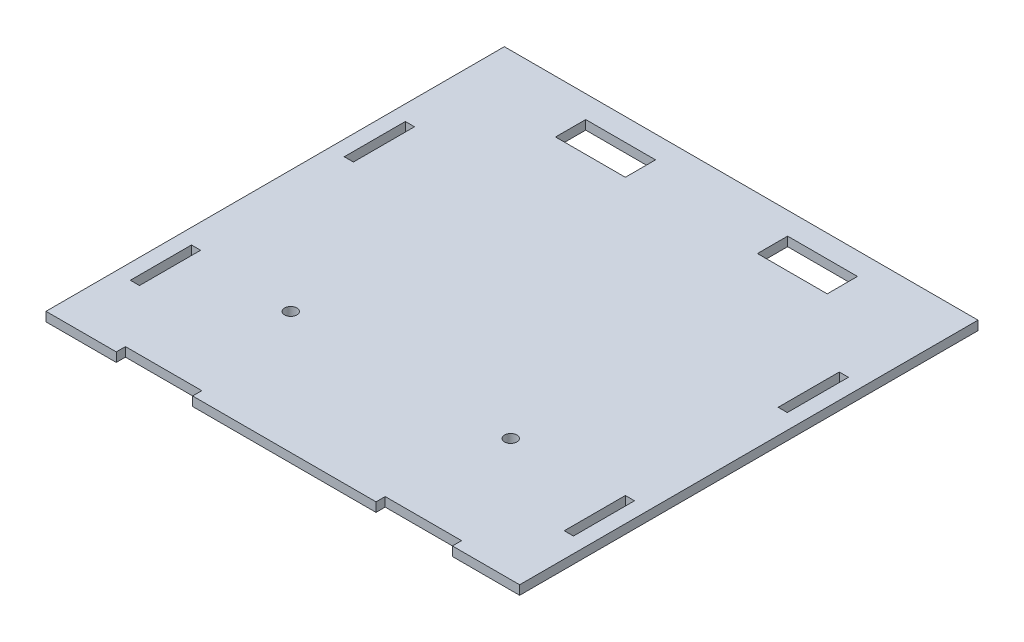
ISO-10303-21;
HEADER;
FILE_DESCRIPTION(('STEP AP214'),'2;1');
FILE_NAME('part.step','',(''),(''),'','','');
FILE_SCHEMA(('AUTOMOTIVE_DESIGN { 1 0 10303 214 1 1 1 1 }'));
ENDSEC;
DATA;
#1=APPLICATION_CONTEXT('core data for automotive mechanical design processes');
#2=APPLICATION_PROTOCOL_DEFINITION('international standard','automotive_design',2000,#1);
#3=PRODUCT_CONTEXT('',#1,'mechanical');
#4=PRODUCT('Part','Part','',(#3));
#5=PRODUCT_RELATED_PRODUCT_CATEGORY('part','',(#4));
#6=PRODUCT_DEFINITION_FORMATION('','',#4);
#7=PRODUCT_DEFINITION_CONTEXT('part definition',#1,'design');
#8=PRODUCT_DEFINITION('design','',#6,#7);
#9=PRODUCT_DEFINITION_SHAPE('','',#8);
#10=(LENGTH_UNIT() NAMED_UNIT(*) SI_UNIT(.MILLI.,.METRE.));
#11=(NAMED_UNIT(*) PLANE_ANGLE_UNIT() SI_UNIT($,.RADIAN.));
#12=(NAMED_UNIT(*) SI_UNIT($,.STERADIAN.) SOLID_ANGLE_UNIT());
#13=UNCERTAINTY_MEASURE_WITH_UNIT(LENGTH_MEASURE(1.E-05),#10,'distance_accuracy_value','');
#14=(GEOMETRIC_REPRESENTATION_CONTEXT(3) GLOBAL_UNCERTAINTY_ASSIGNED_CONTEXT((#13)) GLOBAL_UNIT_ASSIGNED_CONTEXT((#10,
#11,#12)) REPRESENTATION_CONTEXT('',''));
#15=CARTESIAN_POINT('',(0.,0.,0.));
#16=DIRECTION('',(0.,0.,1.));
#17=DIRECTION('',(1.,0.,0.));
#18=AXIS2_PLACEMENT_3D('',#15,#16,#17);
#19=CARTESIAN_POINT('',(-77.5,3.,75.));
#20=DIRECTION('',(0.,0.,-1.));
#21=DIRECTION('',(-1.,0.,0.));
#22=AXIS2_PLACEMENT_3D('',#19,#20,#21);
#23=PLANE('',#22);
#24=DIRECTION('',(1.,0.,0.));
#25=VECTOR('',#24,1.);
#26=CARTESIAN_POINT('',(-77.5,0.,75.));
#27=LINE('',#26,#25);
#28=CARTESIAN_POINT('',(-77.5,0.,75.));
#29=VERTEX_POINT('',#28);
#30=CARTESIAN_POINT('',(-54.5,0.,75.));
#31=VERTEX_POINT('',#30);
#32=EDGE_CURVE('E513',#29,#31,#27,.T.);
#33=ORIENTED_EDGE('',*,*,#32,.T.);
#34=DIRECTION('',(0.,-1.,0.));
#35=VECTOR('',#34,1.);
#36=CARTESIAN_POINT('',(-54.5,10.,75.));
#37=LINE('',#36,#35);
#38=CARTESIAN_POINT('',(-54.5,3.,75.));
#39=VERTEX_POINT('',#38);
#40=EDGE_CURVE('E410',#39,#31,#37,.T.);
#41=ORIENTED_EDGE('',*,*,#40,.F.);
#42=DIRECTION('',(1.,0.,0.));
#43=VECTOR('',#42,1.);
#44=CARTESIAN_POINT('',(-77.5,3.,75.));
#45=LINE('',#44,#43);
#46=CARTESIAN_POINT('',(-77.5,3.,75.));
#47=VERTEX_POINT('',#46);
#48=EDGE_CURVE('E518',#47,#39,#45,.T.);
#49=ORIENTED_EDGE('',*,*,#48,.F.);
#50=DIRECTION('',(0.,-1.,0.));
#51=VECTOR('',#50,1.);
#52=CARTESIAN_POINT('',(-77.5,3.,75.));
#53=LINE('',#52,#51);
#54=EDGE_CURVE('E535',#47,#29,#53,.T.);
#55=ORIENTED_EDGE('',*,*,#54,.T.);
#56=EDGE_LOOP('',(#33,#41,#49,#55));
#57=FACE_BOUND('',#56,.T.);
#58=ADVANCED_FACE('F35',(#57),#23,.F.);
#59=CARTESIAN_POINT('',(55.5,3.,75.));
#60=VERTEX_POINT('',#59);
#61=CARTESIAN_POINT('',(77.5,3.,75.));
#62=VERTEX_POINT('',#61);
#63=EDGE_CURVE('E517',#60,#62,#45,.T.);
#64=ORIENTED_EDGE('',*,*,#63,.F.);
#65=DIRECTION('',(0.,-1.,0.));
#66=VECTOR('',#65,1.);
#67=CARTESIAN_POINT('',(55.5,10.,75.));
#68=LINE('',#67,#66);
#69=CARTESIAN_POINT('',(55.5,0.,75.));
#70=VERTEX_POINT('',#69);
#71=EDGE_CURVE('E433',#60,#70,#68,.T.);
#72=ORIENTED_EDGE('',*,*,#71,.T.);
#73=CARTESIAN_POINT('',(77.5,0.,75.));
#74=VERTEX_POINT('',#73);
#75=EDGE_CURVE('E529',#70,#74,#27,.T.);
#76=ORIENTED_EDGE('',*,*,#75,.T.);
#77=DIRECTION('',(0.,-1.,0.));
#78=VECTOR('',#77,1.);
#79=CARTESIAN_POINT('',(77.5,3.,75.));
#80=LINE('',#79,#78);
#81=EDGE_CURVE('E521',#62,#74,#80,.T.);
#82=ORIENTED_EDGE('',*,*,#81,.F.);
#83=EDGE_LOOP('',(#64,#72,#76,#82));
#84=FACE_BOUND('',#83,.T.);
#85=ADVANCED_FACE('F585',(#84),#23,.F.);
#86=CARTESIAN_POINT('',(77.5,3.,-75.));
#87=DIRECTION('',(-1.,0.,0.));
#88=DIRECTION('',(0.,0.,1.));
#89=AXIS2_PLACEMENT_3D('',#86,#87,#88);
#90=PLANE('',#89);
#91=DIRECTION('',(0.,0.,-1.));
#92=VECTOR('',#91,1.);
#93=CARTESIAN_POINT('',(77.5,0.,-75.));
#94=LINE('',#93,#92);
#95=CARTESIAN_POINT('',(77.5,0.,-75.));
#96=VERTEX_POINT('',#95);
#97=EDGE_CURVE('E508',#74,#96,#94,.T.);
#98=ORIENTED_EDGE('',*,*,#97,.T.);
#99=DIRECTION('',(0.,-1.,0.));
#100=VECTOR('',#99,1.);
#101=CARTESIAN_POINT('',(77.5,3.,-75.));
#102=LINE('',#101,#100);
#103=CARTESIAN_POINT('',(77.5,3.,-75.));
#104=VERTEX_POINT('',#103);
#105=EDGE_CURVE('E11',#104,#96,#102,.T.);
#106=ORIENTED_EDGE('',*,*,#105,.F.);
#107=DIRECTION('',(0.,0.,-1.));
#108=VECTOR('',#107,1.);
#109=CARTESIAN_POINT('',(77.5,3.,-75.));
#110=LINE('',#109,#108);
#111=EDGE_CURVE('E509',#62,#104,#110,.T.);
#112=ORIENTED_EDGE('',*,*,#111,.F.);
#113=ORIENTED_EDGE('',*,*,#81,.T.);
#114=EDGE_LOOP('',(#98,#106,#112,#113));
#115=FACE_BOUND('',#114,.T.);
#116=ADVANCED_FACE('F37',(#115),#90,.F.);
#117=CARTESIAN_POINT('',(-77.5,3.,-75.));
#118=DIRECTION('',(0.,0.,1.));
#119=DIRECTION('',(1.,0.,0.));
#120=AXIS2_PLACEMENT_3D('',#117,#118,#119);
#121=PLANE('',#120);
#122=DIRECTION('',(-1.,0.,0.));
#123=VECTOR('',#122,1.);
#124=CARTESIAN_POINT('',(-77.5,0.,-75.));
#125=LINE('',#124,#123);
#126=CARTESIAN_POINT('',(-77.5,0.,-75.));
#127=VERTEX_POINT('',#126);
#128=EDGE_CURVE('E525',#96,#127,#125,.T.);
#129=ORIENTED_EDGE('',*,*,#128,.T.);
#130=DIRECTION('',(0.,-1.,0.));
#131=VECTOR('',#130,1.);
#132=CARTESIAN_POINT('',(-77.5,3.,-75.));
#133=LINE('',#132,#131);
#134=CARTESIAN_POINT('',(-77.5,3.,-75.));
#135=VERTEX_POINT('',#134);
#136=EDGE_CURVE('E43',#135,#127,#133,.T.);
#137=ORIENTED_EDGE('',*,*,#136,.F.);
#138=DIRECTION('',(-1.,0.,0.));
#139=VECTOR('',#138,1.);
#140=CARTESIAN_POINT('',(-77.5,3.,-75.));
#141=LINE('',#140,#139);
#142=EDGE_CURVE('E512',#104,#135,#141,.T.);
#143=ORIENTED_EDGE('',*,*,#142,.F.);
#144=ORIENTED_EDGE('',*,*,#105,.T.);
#145=EDGE_LOOP('',(#129,#137,#143,#144));
#146=FACE_BOUND('',#145,.T.);
#147=ADVANCED_FACE('F560',(#146),#121,.F.);
#148=CARTESIAN_POINT('',(-77.5,3.,-75.));
#149=DIRECTION('',(1.,0.,0.));
#150=DIRECTION('',(0.,0.,-1.));
#151=AXIS2_PLACEMENT_3D('',#148,#149,#150);
#152=PLANE('',#151);
#153=DIRECTION('',(0.,0.,1.));
#154=VECTOR('',#153,1.);
#155=CARTESIAN_POINT('',(-77.5,0.,-75.));
#156=LINE('',#155,#154);
#157=EDGE_CURVE('E527',#127,#29,#156,.T.);
#158=ORIENTED_EDGE('',*,*,#157,.T.);
#159=ORIENTED_EDGE('',*,*,#54,.F.);
#160=DIRECTION('',(0.,0.,1.));
#161=VECTOR('',#160,1.);
#162=CARTESIAN_POINT('',(-77.5,3.,-75.));
#163=LINE('',#162,#161);
#164=EDGE_CURVE('E515',#135,#47,#163,.T.);
#165=ORIENTED_EDGE('',*,*,#164,.F.);
#166=ORIENTED_EDGE('',*,*,#136,.T.);
#167=EDGE_LOOP('',(#158,#159,#165,#166));
#168=FACE_BOUND('',#167,.T.);
#169=ADVANCED_FACE('F542',(#168),#152,.F.);
#170=CARTESIAN_POINT('',(-29.510112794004,3.,75.));
#171=VERTEX_POINT('',#170);
#172=CARTESIAN_POINT('',(30.5,3.,75.));
#173=VERTEX_POINT('',#172);
#174=EDGE_CURVE('E522',#171,#173,#45,.T.);
#175=ORIENTED_EDGE('',*,*,#174,.F.);
#176=DIRECTION('',(0.,-1.,0.));
#177=VECTOR('',#176,1.);
#178=CARTESIAN_POINT('',(-29.510112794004,10.,75.));
#179=LINE('',#178,#177);
#180=CARTESIAN_POINT('',(-29.510112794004,0.,75.));
#181=VERTEX_POINT('',#180);
#182=EDGE_CURVE('E413',#171,#181,#179,.T.);
#183=ORIENTED_EDGE('',*,*,#182,.T.);
#184=CARTESIAN_POINT('',(30.5,0.,75.));
#185=VERTEX_POINT('',#184);
#186=EDGE_CURVE('E532',#181,#185,#27,.T.);
#187=ORIENTED_EDGE('',*,*,#186,.T.);
#188=DIRECTION('',(0.,-1.,0.));
#189=VECTOR('',#188,1.);
#190=CARTESIAN_POINT('',(30.5,10.,75.));
#191=LINE('',#190,#189);
#192=EDGE_CURVE('E439',#173,#185,#191,.T.);
#193=ORIENTED_EDGE('',*,*,#192,.F.);
#194=EDGE_LOOP('',(#175,#183,#187,#193));
#195=FACE_BOUND('',#194,.T.);
#196=ADVANCED_FACE('F571',(#195),#23,.F.);
#197=CARTESIAN_POINT('',(0.,3.,0.));
#198=DIRECTION('',(0.,1.,0.));
#199=DIRECTION('',(0.,0.,1.));
#200=AXIS2_PLACEMENT_3D('',#197,#198,#199);
#201=PLANE('',#200);
#202=DIRECTION('',(0.,0.,-1.));
#203=VECTOR('',#202,1.);
#204=CARTESIAN_POINT('',(-20.6864428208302,3.,0.));
#205=LINE('',#204,#203);
#206=CARTESIAN_POINT('',(-20.6864428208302,3.,-57.7781504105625));
#207=VERTEX_POINT('',#206);
#208=CARTESIAN_POINT('',(-20.6864428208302,3.,-67.6582425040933));
#209=VERTEX_POINT('',#208);
#210=EDGE_CURVE('E301',#207,#209,#205,.T.);
#211=ORIENTED_EDGE('',*,*,#210,.F.);
#212=DIRECTION('',(1.,0.,0.));
#213=VECTOR('',#212,1.);
#214=CARTESIAN_POINT('',(0.,3.,-57.7781504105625));
#215=LINE('',#214,#213);
#216=CARTESIAN_POINT('',(-43.5341557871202,3.,-57.7781504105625));
#217=VERTEX_POINT('',#216);
#218=EDGE_CURVE('E294',#217,#207,#215,.T.);
#219=ORIENTED_EDGE('',*,*,#218,.F.);
#220=DIRECTION('',(0.,0.,1.));
#221=VECTOR('',#220,1.);
#222=CARTESIAN_POINT('',(-43.5341557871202,3.,0.));
#223=LINE('',#222,#221);
#224=CARTESIAN_POINT('',(-43.5341557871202,3.,-67.6582425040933));
#225=VERTEX_POINT('',#224);
#226=EDGE_CURVE('E274',#225,#217,#223,.T.);
#227=ORIENTED_EDGE('',*,*,#226,.F.);
#228=DIRECTION('',(-1.,0.,0.));
#229=VECTOR('',#228,1.);
#230=CARTESIAN_POINT('',(0.,3.,-67.6582425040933));
#231=LINE('',#230,#229);
#232=EDGE_CURVE('E299',#209,#225,#231,.T.);
#233=ORIENTED_EDGE('',*,*,#232,.F.);
#234=EDGE_LOOP('',(#211,#219,#227,#233));
#235=FACE_BOUND('',#234,.T.);
#236=DIRECTION('',(0.,0.,-1.));
#237=VECTOR('',#236,1.);
#238=CARTESIAN_POINT('',(45.3866730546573,3.,0.));
#239=LINE('',#238,#237);
#240=CARTESIAN_POINT('',(45.3866730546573,3.,-57.7781504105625));
#241=VERTEX_POINT('',#240);
#242=CARTESIAN_POINT('',(45.3866730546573,3.,-67.6582425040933));
#243=VERTEX_POINT('',#242);
#244=EDGE_CURVE('E330',#241,#243,#239,.T.);
#245=ORIENTED_EDGE('',*,*,#244,.F.);
#246=DIRECTION('',(1.,0.,0.));
#247=VECTOR('',#246,1.);
#248=CARTESIAN_POINT('',(0.,3.,-57.7781504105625));
#249=LINE('',#248,#247);
#250=CARTESIAN_POINT('',(22.5389600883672,3.,-57.7781504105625));
#251=VERTEX_POINT('',#250);
#252=EDGE_CURVE('E317',#251,#241,#249,.T.);
#253=ORIENTED_EDGE('',*,*,#252,.F.);
#254=DIRECTION('',(0.,0.,1.));
#255=VECTOR('',#254,1.);
#256=CARTESIAN_POINT('',(22.5389600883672,3.,0.));
#257=LINE('',#256,#255);
#258=CARTESIAN_POINT('',(22.5389600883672,3.,-67.6582425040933));
#259=VERTEX_POINT('',#258);
#260=EDGE_CURVE('E325',#259,#251,#257,.T.);
#261=ORIENTED_EDGE('',*,*,#260,.F.);
#262=DIRECTION('',(-1.,0.,0.));
#263=VECTOR('',#262,1.);
#264=CARTESIAN_POINT('',(0.,3.,-67.6582425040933));
#265=LINE('',#264,#263);
#266=EDGE_CURVE('E328',#243,#259,#265,.T.);
#267=ORIENTED_EDGE('',*,*,#266,.F.);
#268=EDGE_LOOP('',(#245,#253,#261,#267));
#269=FACE_BOUND('',#268,.T.);
#270=CARTESIAN_POINT('',(34.5881566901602,3.,34.9999999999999));
#271=DIRECTION('',(0.,1.,0.));
#272=DIRECTION('',(0.,0.,1.));
#273=AXIS2_PLACEMENT_3D('',#270,#271,#272);
#274=CIRCLE('',#273,2.);
#275=CARTESIAN_POINT('',(34.5881566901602,3.,36.9999999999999));
#276=VERTEX_POINT('',#275);
#277=EDGE_CURVE('E335',#276,#276,#274,.T.);
#278=ORIENTED_EDGE('',*,*,#277,.F.);
#279=EDGE_LOOP('',(#278));
#280=FACE_BOUND('',#279,.T.);
#281=CARTESIAN_POINT('',(-37.4118433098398,3.,35.));
#282=DIRECTION('',(0.,1.,0.));
#283=DIRECTION('',(0.,0.,1.));
#284=AXIS2_PLACEMENT_3D('',#281,#282,#283);
#285=CIRCLE('',#284,2.);
#286=CARTESIAN_POINT('',(-37.4118433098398,3.,37.));
#287=VERTEX_POINT('',#286);
#288=EDGE_CURVE('E341',#287,#287,#285,.T.);
#289=ORIENTED_EDGE('',*,*,#288,.F.);
#290=EDGE_LOOP('',(#289));
#291=FACE_BOUND('',#290,.T.);
#292=DIRECTION('',(0.,0.,-1.));
#293=VECTOR('',#292,1.);
#294=CARTESIAN_POINT('',(-69.5000000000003,3.,0.));
#295=LINE('',#294,#293);
#296=CARTESIAN_POINT('',(-69.5000000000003,3.,-17.5950285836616));
#297=VERTEX_POINT('',#296);
#298=CARTESIAN_POINT('',(-69.5000000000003,3.,-37.5950285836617));
#299=VERTEX_POINT('',#298);
#300=EDGE_CURVE('E371',#297,#299,#295,.T.);
#301=ORIENTED_EDGE('',*,*,#300,.F.);
#302=DIRECTION('',(1.,0.,0.));
#303=VECTOR('',#302,1.);
#304=CARTESIAN_POINT('',(0.,3.,-17.5950285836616));
#305=LINE('',#304,#303);
#306=CARTESIAN_POINT('',(-72.5000000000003,3.,-17.5950285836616));
#307=VERTEX_POINT('',#306);
#308=EDGE_CURVE('E358',#307,#297,#305,.T.);
#309=ORIENTED_EDGE('',*,*,#308,.F.);
#310=DIRECTION('',(0.,0.,1.));
#311=VECTOR('',#310,1.);
#312=CARTESIAN_POINT('',(-72.5000000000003,3.,0.));
#313=LINE('',#312,#311);
#314=CARTESIAN_POINT('',(-72.5000000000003,3.,-37.5950285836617));
#315=VERTEX_POINT('',#314);
#316=EDGE_CURVE('E366',#315,#307,#313,.T.);
#317=ORIENTED_EDGE('',*,*,#316,.F.);
#318=DIRECTION('',(-1.,0.,0.));
#319=VECTOR('',#318,1.);
#320=CARTESIAN_POINT('',(0.,3.,-37.5950285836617));
#321=LINE('',#320,#319);
#322=EDGE_CURVE('E369',#299,#315,#321,.T.);
#323=ORIENTED_EDGE('',*,*,#322,.F.);
#324=EDGE_LOOP('',(#301,#309,#317,#323));
#325=FACE_BOUND('',#324,.T.);
#326=DIRECTION('',(0.,0.,-1.));
#327=VECTOR('',#326,1.);
#328=CARTESIAN_POINT('',(-69.5000000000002,3.,0.));
#329=LINE('',#328,#327);
#330=CARTESIAN_POINT('',(-69.5000000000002,3.,52.4049714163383));
#331=VERTEX_POINT('',#330);
#332=CARTESIAN_POINT('',(-69.5000000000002,3.,32.4049714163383));
#333=VERTEX_POINT('',#332);
#334=EDGE_CURVE('E400',#331,#333,#329,.T.);
#335=ORIENTED_EDGE('',*,*,#334,.F.);
#336=DIRECTION('',(1.,0.,0.));
#337=VECTOR('',#336,1.);
#338=CARTESIAN_POINT('',(0.,3.,52.4049714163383));
#339=LINE('',#338,#337);
#340=CARTESIAN_POINT('',(-72.5000000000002,3.,52.4049714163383));
#341=VERTEX_POINT('',#340);
#342=EDGE_CURVE('E387',#341,#331,#339,.T.);
#343=ORIENTED_EDGE('',*,*,#342,.F.);
#344=DIRECTION('',(0.,0.,1.));
#345=VECTOR('',#344,1.);
#346=CARTESIAN_POINT('',(-72.5000000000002,3.,0.));
#347=LINE('',#346,#345);
#348=CARTESIAN_POINT('',(-72.5000000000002,3.,32.4049714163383));
#349=VERTEX_POINT('',#348);
#350=EDGE_CURVE('E395',#349,#341,#347,.T.);
#351=ORIENTED_EDGE('',*,*,#350,.F.);
#352=DIRECTION('',(-1.,0.,0.));
#353=VECTOR('',#352,1.);
#354=CARTESIAN_POINT('',(0.,3.,32.4049714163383));
#355=LINE('',#354,#353);
#356=EDGE_CURVE('E398',#333,#349,#355,.T.);
#357=ORIENTED_EDGE('',*,*,#356,.F.);
#358=EDGE_LOOP('',(#335,#343,#351,#357));
#359=FACE_BOUND('',#358,.T.);
#360=DIRECTION('',(0.,0.,1.));
#361=VECTOR('',#360,1.);
#362=CARTESIAN_POINT('',(-54.5,3.,0.));
#363=LINE('',#362,#361);
#364=CARTESIAN_POINT('',(-54.5,3.,72.0000000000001));
#365=VERTEX_POINT('',#364);
#366=EDGE_CURVE('E423',#365,#39,#363,.T.);
#367=ORIENTED_EDGE('',*,*,#366,.F.);
#368=DIRECTION('',(-1.,0.,0.));
#369=VECTOR('',#368,1.);
#370=CARTESIAN_POINT('',(0.,3.,72.0000000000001));
#371=LINE('',#370,#369);
#372=CARTESIAN_POINT('',(-29.510112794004,3.,72.0000000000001));
#373=VERTEX_POINT('',#372);
#374=EDGE_CURVE('E412',#373,#365,#371,.T.);
#375=ORIENTED_EDGE('',*,*,#374,.F.);
#376=DIRECTION('',(0.,0.,-1.));
#377=VECTOR('',#376,1.);
#378=CARTESIAN_POINT('',(-29.510112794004,3.,0.));
#379=LINE('',#378,#377);
#380=EDGE_CURVE('E421',#171,#373,#379,.T.);
#381=ORIENTED_EDGE('',*,*,#380,.F.);
#382=ORIENTED_EDGE('',*,*,#174,.T.);
#383=DIRECTION('',(0.,0.,1.));
#384=VECTOR('',#383,1.);
#385=CARTESIAN_POINT('',(30.5,3.,0.));
#386=LINE('',#385,#384);
#387=CARTESIAN_POINT('',(30.5,3.,72.));
#388=VERTEX_POINT('',#387);
#389=EDGE_CURVE('E436',#388,#173,#386,.T.);
#390=ORIENTED_EDGE('',*,*,#389,.F.);
#391=DIRECTION('',(-1.,0.,0.));
#392=VECTOR('',#391,1.);
#393=CARTESIAN_POINT('',(0.,3.,72.));
#394=LINE('',#393,#392);
#395=CARTESIAN_POINT('',(55.5,3.,72.));
#396=VERTEX_POINT('',#395);
#397=EDGE_CURVE('E446',#396,#388,#394,.T.);
#398=ORIENTED_EDGE('',*,*,#397,.F.);
#399=DIRECTION('',(0.,0.,-1.));
#400=VECTOR('',#399,1.);
#401=CARTESIAN_POINT('',(55.5,3.,0.));
#402=LINE('',#401,#400);
#403=EDGE_CURVE('E448',#60,#396,#402,.T.);
#404=ORIENTED_EDGE('',*,*,#403,.F.);
#405=ORIENTED_EDGE('',*,*,#63,.T.);
#406=ORIENTED_EDGE('',*,*,#111,.T.);
#407=ORIENTED_EDGE('',*,*,#142,.T.);
#408=ORIENTED_EDGE('',*,*,#164,.T.);
#409=ORIENTED_EDGE('',*,*,#48,.T.);
#410=EDGE_LOOP('',(#367,#375,#381,#382,#390,#398,#404,#405,#406,#407,#408,#409));
#411=FACE_BOUND('',#410,.T.);
#412=DIRECTION('',(0.,0.,-1.));
#413=VECTOR('',#412,1.);
#414=CARTESIAN_POINT('',(72.5,3.,0.));
#415=LINE('',#414,#413);
#416=CARTESIAN_POINT('',(72.5,3.,52.4049589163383));
#417=VERTEX_POINT('',#416);
#418=CARTESIAN_POINT('',(72.5,3.,32.4049589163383));
#419=VERTEX_POINT('',#418);
#420=EDGE_CURVE('E477',#417,#419,#415,.T.);
#421=ORIENTED_EDGE('',*,*,#420,.F.);
#422=DIRECTION('',(1.,0.,0.));
#423=VECTOR('',#422,1.);
#424=CARTESIAN_POINT('',(0.,3.,52.4049589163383));
#425=LINE('',#424,#423);
#426=CARTESIAN_POINT('',(69.5,3.,52.4049589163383));
#427=VERTEX_POINT('',#426);
#428=EDGE_CURVE('E464',#427,#417,#425,.T.);
#429=ORIENTED_EDGE('',*,*,#428,.F.);
#430=DIRECTION('',(0.,0.,1.));
#431=VECTOR('',#430,1.);
#432=CARTESIAN_POINT('',(69.5,3.,0.));
#433=LINE('',#432,#431);
#434=CARTESIAN_POINT('',(69.5,3.,32.4049589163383));
#435=VERTEX_POINT('',#434);
#436=EDGE_CURVE('E472',#435,#427,#433,.T.);
#437=ORIENTED_EDGE('',*,*,#436,.F.);
#438=DIRECTION('',(-1.,0.,0.));
#439=VECTOR('',#438,1.);
#440=CARTESIAN_POINT('',(0.,3.,32.4049589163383));
#441=LINE('',#440,#439);
#442=EDGE_CURVE('E475',#419,#435,#441,.T.);
#443=ORIENTED_EDGE('',*,*,#442,.F.);
#444=EDGE_LOOP('',(#421,#429,#437,#443));
#445=FACE_BOUND('',#444,.T.);
#446=DIRECTION('',(0.,0.,1.));
#447=VECTOR('',#446,1.);
#448=CARTESIAN_POINT('',(69.4999999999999,3.,0.));
#449=LINE('',#448,#447);
#450=CARTESIAN_POINT('',(69.4999999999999,3.,-37.5950410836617));
#451=VERTEX_POINT('',#450);
#452=CARTESIAN_POINT('',(69.4999999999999,3.,-17.5950410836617));
#453=VERTEX_POINT('',#452);
#454=EDGE_CURVE('E506',#451,#453,#449,.T.);
#455=ORIENTED_EDGE('',*,*,#454,.F.);
#456=DIRECTION('',(-1.,0.,0.));
#457=VECTOR('',#456,1.);
#458=CARTESIAN_POINT('',(0.,3.,-37.5950410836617));
#459=LINE('',#458,#457);
#460=CARTESIAN_POINT('',(72.4999999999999,3.,-37.5950410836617));
#461=VERTEX_POINT('',#460);
#462=EDGE_CURVE('E493',#461,#451,#459,.T.);
#463=ORIENTED_EDGE('',*,*,#462,.F.);
#464=DIRECTION('',(0.,0.,-1.));
#465=VECTOR('',#464,1.);
#466=CARTESIAN_POINT('',(72.4999999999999,3.,0.));
#467=LINE('',#466,#465);
#468=CARTESIAN_POINT('',(72.4999999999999,3.,-17.5950410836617));
#469=VERTEX_POINT('',#468);
#470=EDGE_CURVE('E501',#469,#461,#467,.T.);
#471=ORIENTED_EDGE('',*,*,#470,.F.);
#472=DIRECTION('',(1.,0.,0.));
#473=VECTOR('',#472,1.);
#474=CARTESIAN_POINT('',(0.,3.,-17.5950410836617));
#475=LINE('',#474,#473);
#476=EDGE_CURVE('E504',#453,#469,#475,.T.);
#477=ORIENTED_EDGE('',*,*,#476,.F.);
#478=EDGE_LOOP('',(#455,#463,#471,#477));
#479=FACE_BOUND('',#478,.T.);
#480=ADVANCED_FACE('F555',(#235,#269,#280,#291,#325,#359,#411,#445,#479),#201,.T.);
#481=CARTESIAN_POINT('',(0.,0.,0.));
#482=DIRECTION('',(0.,1.,0.));
#483=DIRECTION('',(0.,0.,1.));
#484=AXIS2_PLACEMENT_3D('',#481,#482,#483);
#485=PLANE('',#484);
#486=DIRECTION('',(-1.,0.,0.));
#487=VECTOR('',#486,1.);
#488=CARTESIAN_POINT('',(-20.6864428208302,0.,-57.7781504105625));
#489=LINE('',#488,#487);
#490=CARTESIAN_POINT('',(-20.6864428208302,0.,-57.7781504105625));
#491=VERTEX_POINT('',#490);
#492=CARTESIAN_POINT('',(-43.5341557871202,0.,-57.7781504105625));
#493=VERTEX_POINT('',#492);
#494=EDGE_CURVE('E280',#491,#493,#489,.T.);
#495=ORIENTED_EDGE('',*,*,#494,.F.);
#496=DIRECTION('',(0.,0.,1.));
#497=VECTOR('',#496,1.);
#498=CARTESIAN_POINT('',(-20.6864428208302,0.,-57.7781504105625));
#499=LINE('',#498,#497);
#500=CARTESIAN_POINT('',(-20.6864428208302,0.,-67.6582425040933));
#501=VERTEX_POINT('',#500);
#502=EDGE_CURVE('E58',#501,#491,#499,.T.);
#503=ORIENTED_EDGE('',*,*,#502,.F.);
#504=DIRECTION('',(1.,0.,0.));
#505=VECTOR('',#504,1.);
#506=CARTESIAN_POINT('',(-20.6864428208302,0.,-67.6582425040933));
#507=LINE('',#506,#505);
#508=CARTESIAN_POINT('',(-43.5341557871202,0.,-67.6582425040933));
#509=VERTEX_POINT('',#508);
#510=EDGE_CURVE('E287',#509,#501,#507,.T.);
#511=ORIENTED_EDGE('',*,*,#510,.F.);
#512=DIRECTION('',(0.,0.,-1.));
#513=VECTOR('',#512,1.);
#514=CARTESIAN_POINT('',(-43.5341557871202,0.,-57.7781504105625));
#515=LINE('',#514,#513);
#516=EDGE_CURVE('E271',#493,#509,#515,.T.);
#517=ORIENTED_EDGE('',*,*,#516,.F.);
#518=EDGE_LOOP('',(#495,#503,#511,#517));
#519=FACE_BOUND('',#518,.T.);
#520=DIRECTION('',(-1.,0.,0.));
#521=VECTOR('',#520,1.);
#522=CARTESIAN_POINT('',(45.3866730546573,0.,-57.7781504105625));
#523=LINE('',#522,#521);
#524=CARTESIAN_POINT('',(45.3866730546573,0.,-57.7781504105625));
#525=VERTEX_POINT('',#524);
#526=CARTESIAN_POINT('',(22.5389600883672,0.,-57.7781504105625));
#527=VERTEX_POINT('',#526);
#528=EDGE_CURVE('E305',#525,#527,#523,.T.);
#529=ORIENTED_EDGE('',*,*,#528,.F.);
#530=DIRECTION('',(0.,0.,1.));
#531=VECTOR('',#530,1.);
#532=CARTESIAN_POINT('',(45.3866730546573,0.,-57.7781504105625));
#533=LINE('',#532,#531);
#534=CARTESIAN_POINT('',(45.3866730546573,0.,-67.6582425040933));
#535=VERTEX_POINT('',#534);
#536=EDGE_CURVE('E303',#535,#525,#533,.T.);
#537=ORIENTED_EDGE('',*,*,#536,.F.);
#538=DIRECTION('',(1.,0.,0.));
#539=VECTOR('',#538,1.);
#540=CARTESIAN_POINT('',(45.3866730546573,0.,-67.6582425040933));
#541=LINE('',#540,#539);
#542=CARTESIAN_POINT('',(22.5389600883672,0.,-67.6582425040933));
#543=VERTEX_POINT('',#542);
#544=EDGE_CURVE('E311',#543,#535,#541,.T.);
#545=ORIENTED_EDGE('',*,*,#544,.F.);
#546=DIRECTION('',(0.,0.,-1.));
#547=VECTOR('',#546,1.);
#548=CARTESIAN_POINT('',(22.5389600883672,0.,-57.7781504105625));
#549=LINE('',#548,#547);
#550=EDGE_CURVE('E308',#527,#543,#549,.T.);
#551=ORIENTED_EDGE('',*,*,#550,.F.);
#552=EDGE_LOOP('',(#529,#537,#545,#551));
#553=FACE_BOUND('',#552,.T.);
#554=CARTESIAN_POINT('',(34.5881566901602,0.,34.9999999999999));
#555=DIRECTION('',(0.,-1.,0.));
#556=DIRECTION('',(0.,0.,-1.));
#557=AXIS2_PLACEMENT_3D('',#554,#555,#556);
#558=CIRCLE('',#557,2.);
#559=CARTESIAN_POINT('',(34.5881566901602,0.,32.9999999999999));
#560=VERTEX_POINT('',#559);
#561=EDGE_CURVE('E332',#560,#560,#558,.T.);
#562=ORIENTED_EDGE('',*,*,#561,.F.);
#563=EDGE_LOOP('',(#562));
#564=FACE_BOUND('',#563,.T.);
#565=CARTESIAN_POINT('',(-37.4118433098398,0.,35.));
#566=DIRECTION('',(0.,-1.,0.));
#567=DIRECTION('',(0.,0.,-1.));
#568=AXIS2_PLACEMENT_3D('',#565,#566,#567);
#569=CIRCLE('',#568,2.);
#570=CARTESIAN_POINT('',(-37.4118433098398,0.,33.));
#571=VERTEX_POINT('',#570);
#572=EDGE_CURVE('E338',#571,#571,#569,.T.);
#573=ORIENTED_EDGE('',*,*,#572,.F.);
#574=EDGE_LOOP('',(#573));
#575=FACE_BOUND('',#574,.T.);
#576=DIRECTION('',(-1.,0.,0.));
#577=VECTOR('',#576,1.);
#578=CARTESIAN_POINT('',(-69.5000000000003,0.,-17.5950285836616));
#579=LINE('',#578,#577);
#580=CARTESIAN_POINT('',(-69.5000000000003,0.,-17.5950285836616));
#581=VERTEX_POINT('',#580);
#582=CARTESIAN_POINT('',(-72.5000000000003,0.,-17.5950285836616));
#583=VERTEX_POINT('',#582);
#584=EDGE_CURVE('E346',#581,#583,#579,.T.);
#585=ORIENTED_EDGE('',*,*,#584,.F.);
#586=DIRECTION('',(0.,0.,1.));
#587=VECTOR('',#586,1.);
#588=CARTESIAN_POINT('',(-69.5000000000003,0.,-17.5950285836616));
#589=LINE('',#588,#587);
#590=CARTESIAN_POINT('',(-69.5000000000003,0.,-37.5950285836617));
#591=VERTEX_POINT('',#590);
#592=EDGE_CURVE('E344',#591,#581,#589,.T.);
#593=ORIENTED_EDGE('',*,*,#592,.F.);
#594=DIRECTION('',(1.,0.,0.));
#595=VECTOR('',#594,1.);
#596=CARTESIAN_POINT('',(-69.5000000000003,0.,-37.5950285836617));
#597=LINE('',#596,#595);
#598=CARTESIAN_POINT('',(-72.5000000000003,0.,-37.5950285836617));
#599=VERTEX_POINT('',#598);
#600=EDGE_CURVE('E352',#599,#591,#597,.T.);
#601=ORIENTED_EDGE('',*,*,#600,.F.);
#602=DIRECTION('',(0.,0.,-1.));
#603=VECTOR('',#602,1.);
#604=CARTESIAN_POINT('',(-72.5000000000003,0.,-17.5950285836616));
#605=LINE('',#604,#603);
#606=EDGE_CURVE('E349',#583,#599,#605,.T.);
#607=ORIENTED_EDGE('',*,*,#606,.F.);
#608=EDGE_LOOP('',(#585,#593,#601,#607));
#609=FACE_BOUND('',#608,.T.);
#610=DIRECTION('',(-1.,0.,0.));
#611=VECTOR('',#610,1.);
#612=CARTESIAN_POINT('',(-69.5000000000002,0.,52.4049714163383));
#613=LINE('',#612,#611);
#614=CARTESIAN_POINT('',(-69.5000000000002,0.,52.4049714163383));
#615=VERTEX_POINT('',#614);
#616=CARTESIAN_POINT('',(-72.5000000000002,0.,52.4049714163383));
#617=VERTEX_POINT('',#616);
#618=EDGE_CURVE('E375',#615,#617,#613,.T.);
#619=ORIENTED_EDGE('',*,*,#618,.F.);
#620=DIRECTION('',(0.,0.,1.));
#621=VECTOR('',#620,1.);
#622=CARTESIAN_POINT('',(-69.5000000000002,0.,32.4049714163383));
#623=LINE('',#622,#621);
#624=CARTESIAN_POINT('',(-69.5000000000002,0.,32.4049714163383));
#625=VERTEX_POINT('',#624);
#626=EDGE_CURVE('E373',#625,#615,#623,.T.);
#627=ORIENTED_EDGE('',*,*,#626,.F.);
#628=DIRECTION('',(1.,0.,0.));
#629=VECTOR('',#628,1.);
#630=CARTESIAN_POINT('',(-69.5000000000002,0.,32.4049714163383));
#631=LINE('',#630,#629);
#632=CARTESIAN_POINT('',(-72.5000000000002,0.,32.4049714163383));
#633=VERTEX_POINT('',#632);
#634=EDGE_CURVE('E381',#633,#625,#631,.T.);
#635=ORIENTED_EDGE('',*,*,#634,.F.);
#636=DIRECTION('',(0.,0.,-1.));
#637=VECTOR('',#636,1.);
#638=CARTESIAN_POINT('',(-72.5000000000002,0.,32.4049714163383));
#639=LINE('',#638,#637);
#640=EDGE_CURVE('E378',#617,#633,#639,.T.);
#641=ORIENTED_EDGE('',*,*,#640,.F.);
#642=EDGE_LOOP('',(#619,#627,#635,#641));
#643=FACE_BOUND('',#642,.T.);
#644=DIRECTION('',(-1.,0.,0.));
#645=VECTOR('',#644,1.);
#646=CARTESIAN_POINT('',(72.5,0.,52.4049589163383));
#647=LINE('',#646,#645);
#648=CARTESIAN_POINT('',(72.5,0.,52.4049589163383));
#649=VERTEX_POINT('',#648);
#650=CARTESIAN_POINT('',(69.5,0.,52.4049589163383));
#651=VERTEX_POINT('',#650);
#652=EDGE_CURVE('E452',#649,#651,#647,.T.);
#653=ORIENTED_EDGE('',*,*,#652,.F.);
#654=DIRECTION('',(0.,0.,1.));
#655=VECTOR('',#654,1.);
#656=CARTESIAN_POINT('',(72.5,0.,32.4049589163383));
#657=LINE('',#656,#655);
#658=CARTESIAN_POINT('',(72.5,0.,32.4049589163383));
#659=VERTEX_POINT('',#658);
#660=EDGE_CURVE('E450',#659,#649,#657,.T.);
#661=ORIENTED_EDGE('',*,*,#660,.F.);
#662=DIRECTION('',(1.,0.,0.));
#663=VECTOR('',#662,1.);
#664=CARTESIAN_POINT('',(72.5,0.,32.4049589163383));
#665=LINE('',#664,#663);
#666=CARTESIAN_POINT('',(69.5,0.,32.4049589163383));
#667=VERTEX_POINT('',#666);
#668=EDGE_CURVE('E458',#667,#659,#665,.T.);
#669=ORIENTED_EDGE('',*,*,#668,.F.);
#670=DIRECTION('',(0.,0.,-1.));
#671=VECTOR('',#670,1.);
#672=CARTESIAN_POINT('',(69.5,0.,32.4049589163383));
#673=LINE('',#672,#671);
#674=EDGE_CURVE('E455',#651,#667,#673,.T.);
#675=ORIENTED_EDGE('',*,*,#674,.F.);
#676=EDGE_LOOP('',(#653,#661,#669,#675));
#677=FACE_BOUND('',#676,.T.);
#678=DIRECTION('',(1.,0.,0.));
#679=VECTOR('',#678,1.);
#680=CARTESIAN_POINT('',(69.4999999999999,0.,-37.5950410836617));
#681=LINE('',#680,#679);
#682=CARTESIAN_POINT('',(69.4999999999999,0.,-37.5950410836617));
#683=VERTEX_POINT('',#682);
#684=CARTESIAN_POINT('',(72.4999999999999,0.,-37.5950410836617));
#685=VERTEX_POINT('',#684);
#686=EDGE_CURVE('E481',#683,#685,#681,.T.);
#687=ORIENTED_EDGE('',*,*,#686,.F.);
#688=DIRECTION('',(0.,0.,-1.));
#689=VECTOR('',#688,1.);
#690=CARTESIAN_POINT('',(69.4999999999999,0.,-17.5950410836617));
#691=LINE('',#690,#689);
#692=CARTESIAN_POINT('',(69.4999999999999,0.,-17.5950410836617));
#693=VERTEX_POINT('',#692);
#694=EDGE_CURVE('E479',#693,#683,#691,.T.);
#695=ORIENTED_EDGE('',*,*,#694,.F.);
#696=DIRECTION('',(-1.,0.,0.));
#697=VECTOR('',#696,1.);
#698=CARTESIAN_POINT('',(69.4999999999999,0.,-17.5950410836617));
#699=LINE('',#698,#697);
#700=CARTESIAN_POINT('',(72.4999999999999,0.,-17.5950410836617));
#701=VERTEX_POINT('',#700);
#702=EDGE_CURVE('E487',#701,#693,#699,.T.);
#703=ORIENTED_EDGE('',*,*,#702,.F.);
#704=DIRECTION('',(0.,0.,1.));
#705=VECTOR('',#704,1.);
#706=CARTESIAN_POINT('',(72.4999999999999,0.,-17.5950410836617));
#707=LINE('',#706,#705);
#708=EDGE_CURVE('E484',#685,#701,#707,.T.);
#709=ORIENTED_EDGE('',*,*,#708,.F.);
#710=EDGE_LOOP('',(#687,#695,#703,#709));
#711=FACE_BOUND('',#710,.T.);
#712=DIRECTION('',(1.,0.,0.));
#713=VECTOR('',#712,1.);
#714=CARTESIAN_POINT('',(-54.5,0.,72.0000000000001));
#715=LINE('',#714,#713);
#716=CARTESIAN_POINT('',(-54.5,0.,72.0000000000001));
#717=VERTEX_POINT('',#716);
#718=CARTESIAN_POINT('',(-29.510112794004,0.,72.0000000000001));
#719=VERTEX_POINT('',#718);
#720=EDGE_CURVE('E404',#717,#719,#715,.T.);
#721=ORIENTED_EDGE('',*,*,#720,.F.);
#722=DIRECTION('',(0.,0.,-1.));
#723=VECTOR('',#722,1.);
#724=CARTESIAN_POINT('',(-54.5,0.,72.0000000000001));
#725=LINE('',#724,#723);
#726=EDGE_CURVE('E402',#31,#717,#725,.T.);
#727=ORIENTED_EDGE('',*,*,#726,.F.);
#728=ORIENTED_EDGE('',*,*,#32,.F.);
#729=ORIENTED_EDGE('',*,*,#157,.F.);
#730=ORIENTED_EDGE('',*,*,#128,.F.);
#731=ORIENTED_EDGE('',*,*,#97,.F.);
#732=ORIENTED_EDGE('',*,*,#75,.F.);
#733=DIRECTION('',(0.,0.,1.));
#734=VECTOR('',#733,1.);
#735=CARTESIAN_POINT('',(55.5,0.,72.));
#736=LINE('',#735,#734);
#737=CARTESIAN_POINT('',(55.5,0.,72.));
#738=VERTEX_POINT('',#737);
#739=EDGE_CURVE('E425',#738,#70,#736,.T.);
#740=ORIENTED_EDGE('',*,*,#739,.F.);
#741=DIRECTION('',(1.,0.,0.));
#742=VECTOR('',#741,1.);
#743=CARTESIAN_POINT('',(55.5,0.,72.));
#744=LINE('',#743,#742);
#745=CARTESIAN_POINT('',(30.5,0.,72.));
#746=VERTEX_POINT('',#745);
#747=EDGE_CURVE('E430',#746,#738,#744,.T.);
#748=ORIENTED_EDGE('',*,*,#747,.F.);
#749=DIRECTION('',(0.,0.,-1.));
#750=VECTOR('',#749,1.);
#751=CARTESIAN_POINT('',(30.5,0.,72.));
#752=LINE('',#751,#750);
#753=EDGE_CURVE('E427',#185,#746,#752,.T.);
#754=ORIENTED_EDGE('',*,*,#753,.F.);
#755=ORIENTED_EDGE('',*,*,#186,.F.);
#756=DIRECTION('',(0.,0.,1.));
#757=VECTOR('',#756,1.);
#758=CARTESIAN_POINT('',(-29.510112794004,0.,72.0000000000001));
#759=LINE('',#758,#757);
#760=EDGE_CURVE('E407',#719,#181,#759,.T.);
#761=ORIENTED_EDGE('',*,*,#760,.F.);
#762=EDGE_LOOP('',(#721,#727,#728,#729,#730,#731,#732,#740,#748,#754,#755,#761));
#763=FACE_BOUND('',#762,.T.);
#764=ADVANCED_FACE('F284',(#519,#553,#564,#575,#609,#643,#677,#711,#763),#485,.F.);
#765=CARTESIAN_POINT('',(69.4999999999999,10.,-17.5950410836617));
#766=DIRECTION('',(-1.,0.,0.));
#767=DIRECTION('',(0.,0.,1.));
#768=AXIS2_PLACEMENT_3D('',#765,#766,#767);
#769=PLANE('',#768);
#770=ORIENTED_EDGE('',*,*,#454,.T.);
#771=DIRECTION('',(0.,-1.,0.));
#772=VECTOR('',#771,1.);
#773=CARTESIAN_POINT('',(69.4999999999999,10.,-17.5950410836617));
#774=LINE('',#773,#772);
#775=EDGE_CURVE('E491',#453,#693,#774,.T.);
#776=ORIENTED_EDGE('',*,*,#775,.T.);
#777=ORIENTED_EDGE('',*,*,#694,.T.);
#778=DIRECTION('',(0.,-1.,0.));
#779=VECTOR('',#778,1.);
#780=CARTESIAN_POINT('',(69.4999999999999,10.,-37.5950410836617));
#781=LINE('',#780,#779);
#782=EDGE_CURVE('E490',#451,#683,#781,.T.);
#783=ORIENTED_EDGE('',*,*,#782,.F.);
#784=EDGE_LOOP('',(#770,#776,#777,#783));
#785=FACE_BOUND('',#784,.T.);
#786=ADVANCED_FACE('F636',(#785),#769,.F.);
#787=CARTESIAN_POINT('',(69.4999999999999,10.,-17.5950410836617));
#788=DIRECTION('',(0.,0.,1.));
#789=DIRECTION('',(1.,0.,0.));
#790=AXIS2_PLACEMENT_3D('',#787,#788,#789);
#791=PLANE('',#790);
#792=ORIENTED_EDGE('',*,*,#476,.T.);
#793=DIRECTION('',(0.,-1.,0.));
#794=VECTOR('',#793,1.);
#795=CARTESIAN_POINT('',(72.4999999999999,10.,-17.5950410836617));
#796=LINE('',#795,#794);
#797=EDGE_CURVE('E494',#469,#701,#796,.T.);
#798=ORIENTED_EDGE('',*,*,#797,.T.);
#799=ORIENTED_EDGE('',*,*,#702,.T.);
#800=ORIENTED_EDGE('',*,*,#775,.F.);
#801=EDGE_LOOP('',(#792,#798,#799,#800));
#802=FACE_BOUND('',#801,.T.);
#803=ADVANCED_FACE('F651',(#802),#791,.F.);
#804=CARTESIAN_POINT('',(72.4999999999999,10.,-17.5950410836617));
#805=DIRECTION('',(1.,0.,0.));
#806=DIRECTION('',(0.,0.,-1.));
#807=AXIS2_PLACEMENT_3D('',#804,#805,#806);
#808=PLANE('',#807);
#809=ORIENTED_EDGE('',*,*,#470,.T.);
#810=DIRECTION('',(0.,-1.,0.));
#811=VECTOR('',#810,1.);
#812=CARTESIAN_POINT('',(72.4999999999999,10.,-37.5950410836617));
#813=LINE('',#812,#811);
#814=EDGE_CURVE('E496',#461,#685,#813,.T.);
#815=ORIENTED_EDGE('',*,*,#814,.T.);
#816=ORIENTED_EDGE('',*,*,#708,.T.);
#817=ORIENTED_EDGE('',*,*,#797,.F.);
#818=EDGE_LOOP('',(#809,#815,#816,#817));
#819=FACE_BOUND('',#818,.T.);
#820=ADVANCED_FACE('F660',(#819),#808,.F.);
#821=CARTESIAN_POINT('',(69.4999999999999,10.,-37.5950410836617));
#822=DIRECTION('',(0.,0.,-1.));
#823=DIRECTION('',(-1.,0.,0.));
#824=AXIS2_PLACEMENT_3D('',#821,#822,#823);
#825=PLANE('',#824);
#826=ORIENTED_EDGE('',*,*,#462,.T.);
#827=ORIENTED_EDGE('',*,*,#782,.T.);
#828=ORIENTED_EDGE('',*,*,#686,.T.);
#829=ORIENTED_EDGE('',*,*,#814,.F.);
#830=EDGE_LOOP('',(#826,#827,#828,#829));
#831=FACE_BOUND('',#830,.T.);
#832=ADVANCED_FACE('F669',(#831),#825,.F.);
#833=CARTESIAN_POINT('',(72.5,10.,32.4049589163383));
#834=DIRECTION('',(1.,0.,0.));
#835=DIRECTION('',(0.,0.,-1.));
#836=AXIS2_PLACEMENT_3D('',#833,#834,#835);
#837=PLANE('',#836);
#838=ORIENTED_EDGE('',*,*,#420,.T.);
#839=DIRECTION('',(0.,-1.,0.));
#840=VECTOR('',#839,1.);
#841=CARTESIAN_POINT('',(72.5,10.,32.4049589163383));
#842=LINE('',#841,#840);
#843=EDGE_CURVE('E462',#419,#659,#842,.T.);
#844=ORIENTED_EDGE('',*,*,#843,.T.);
#845=ORIENTED_EDGE('',*,*,#660,.T.);
#846=DIRECTION('',(0.,-1.,0.));
#847=VECTOR('',#846,1.);
#848=CARTESIAN_POINT('',(72.5,10.,52.4049589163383));
#849=LINE('',#848,#847);
#850=EDGE_CURVE('E461',#417,#649,#849,.T.);
#851=ORIENTED_EDGE('',*,*,#850,.F.);
#852=EDGE_LOOP('',(#838,#844,#845,#851));
#853=FACE_BOUND('',#852,.T.);
#854=ADVANCED_FACE('F678',(#853),#837,.F.);
#855=CARTESIAN_POINT('',(72.5,10.,32.4049589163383));
#856=DIRECTION('',(0.,0.,-1.));
#857=DIRECTION('',(-1.,0.,0.));
#858=AXIS2_PLACEMENT_3D('',#855,#856,#857);
#859=PLANE('',#858);
#860=ORIENTED_EDGE('',*,*,#442,.T.);
#861=DIRECTION('',(0.,-1.,0.));
#862=VECTOR('',#861,1.);
#863=CARTESIAN_POINT('',(69.5,10.,32.4049589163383));
#864=LINE('',#863,#862);
#865=EDGE_CURVE('E465',#435,#667,#864,.T.);
#866=ORIENTED_EDGE('',*,*,#865,.T.);
#867=ORIENTED_EDGE('',*,*,#668,.T.);
#868=ORIENTED_EDGE('',*,*,#843,.F.);
#869=EDGE_LOOP('',(#860,#866,#867,#868));
#870=FACE_BOUND('',#869,.T.);
#871=ADVANCED_FACE('F687',(#870),#859,.F.);
#872=CARTESIAN_POINT('',(69.5,10.,32.4049589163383));
#873=DIRECTION('',(-1.,0.,0.));
#874=DIRECTION('',(0.,0.,1.));
#875=AXIS2_PLACEMENT_3D('',#872,#873,#874);
#876=PLANE('',#875);
#877=ORIENTED_EDGE('',*,*,#436,.T.);
#878=DIRECTION('',(0.,-1.,0.));
#879=VECTOR('',#878,1.);
#880=CARTESIAN_POINT('',(69.5,10.,52.4049589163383));
#881=LINE('',#880,#879);
#882=EDGE_CURVE('E467',#427,#651,#881,.T.);
#883=ORIENTED_EDGE('',*,*,#882,.T.);
#884=ORIENTED_EDGE('',*,*,#674,.T.);
#885=ORIENTED_EDGE('',*,*,#865,.F.);
#886=EDGE_LOOP('',(#877,#883,#884,#885));
#887=FACE_BOUND('',#886,.T.);
#888=ADVANCED_FACE('F696',(#887),#876,.F.);
#889=CARTESIAN_POINT('',(72.5,10.,52.4049589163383));
#890=DIRECTION('',(0.,0.,1.));
#891=DIRECTION('',(1.,0.,0.));
#892=AXIS2_PLACEMENT_3D('',#889,#890,#891);
#893=PLANE('',#892);
#894=ORIENTED_EDGE('',*,*,#428,.T.);
#895=ORIENTED_EDGE('',*,*,#850,.T.);
#896=ORIENTED_EDGE('',*,*,#652,.T.);
#897=ORIENTED_EDGE('',*,*,#882,.F.);
#898=EDGE_LOOP('',(#894,#895,#896,#897));
#899=FACE_BOUND('',#898,.T.);
#900=ADVANCED_FACE('F705',(#899),#893,.F.);
#901=CARTESIAN_POINT('',(55.5,10.,72.));
#902=DIRECTION('',(1.,0.,0.));
#903=DIRECTION('',(0.,0.,-1.));
#904=AXIS2_PLACEMENT_3D('',#901,#902,#903);
#905=PLANE('',#904);
#906=ORIENTED_EDGE('',*,*,#403,.T.);
#907=DIRECTION('',(0.,-1.,0.));
#908=VECTOR('',#907,1.);
#909=CARTESIAN_POINT('',(55.5,10.,72.));
#910=LINE('',#909,#908);
#911=EDGE_CURVE('E434',#396,#738,#910,.T.);
#912=ORIENTED_EDGE('',*,*,#911,.T.);
#913=ORIENTED_EDGE('',*,*,#739,.T.);
#914=ORIENTED_EDGE('',*,*,#71,.F.);
#915=EDGE_LOOP('',(#906,#912,#913,#914));
#916=FACE_BOUND('',#915,.T.);
#917=ADVANCED_FACE('F714',(#916),#905,.F.);
#918=CARTESIAN_POINT('',(55.5,10.,72.));
#919=DIRECTION('',(0.,0.,-1.));
#920=DIRECTION('',(-1.,0.,0.));
#921=AXIS2_PLACEMENT_3D('',#918,#919,#920);
#922=PLANE('',#921);
#923=ORIENTED_EDGE('',*,*,#397,.T.);
#924=DIRECTION('',(0.,-1.,0.));
#925=VECTOR('',#924,1.);
#926=CARTESIAN_POINT('',(30.5,10.,72.));
#927=LINE('',#926,#925);
#928=EDGE_CURVE('E437',#388,#746,#927,.T.);
#929=ORIENTED_EDGE('',*,*,#928,.T.);
#930=ORIENTED_EDGE('',*,*,#747,.T.);
#931=ORIENTED_EDGE('',*,*,#911,.F.);
#932=EDGE_LOOP('',(#923,#929,#930,#931));
#933=FACE_BOUND('',#932,.T.);
#934=ADVANCED_FACE('F580',(#933),#922,.F.);
#935=CARTESIAN_POINT('',(30.5,10.,72.));
#936=DIRECTION('',(-1.,0.,0.));
#937=DIRECTION('',(0.,0.,1.));
#938=AXIS2_PLACEMENT_3D('',#935,#936,#937);
#939=PLANE('',#938);
#940=ORIENTED_EDGE('',*,*,#389,.T.);
#941=ORIENTED_EDGE('',*,*,#192,.T.);
#942=ORIENTED_EDGE('',*,*,#753,.T.);
#943=ORIENTED_EDGE('',*,*,#928,.F.);
#944=EDGE_LOOP('',(#940,#941,#942,#943));
#945=FACE_BOUND('',#944,.T.);
#946=ADVANCED_FACE('F575',(#945),#939,.F.);
#947=CARTESIAN_POINT('',(-54.5,10.,72.0000000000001));
#948=DIRECTION('',(-1.,0.,0.));
#949=DIRECTION('',(0.,0.,1.));
#950=AXIS2_PLACEMENT_3D('',#947,#948,#949);
#951=PLANE('',#950);
#952=ORIENTED_EDGE('',*,*,#366,.T.);
#953=ORIENTED_EDGE('',*,*,#40,.T.);
#954=ORIENTED_EDGE('',*,*,#726,.T.);
#955=DIRECTION('',(0.,-1.,0.));
#956=VECTOR('',#955,1.);
#957=CARTESIAN_POINT('',(-54.5,10.,72.0000000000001));
#958=LINE('',#957,#956);
#959=EDGE_CURVE('E409',#365,#717,#958,.T.);
#960=ORIENTED_EDGE('',*,*,#959,.F.);
#961=EDGE_LOOP('',(#952,#953,#954,#960));
#962=FACE_BOUND('',#961,.T.);
#963=ADVANCED_FACE('F738',(#962),#951,.F.);
#964=CARTESIAN_POINT('',(-29.510112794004,10.,72.0000000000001));
#965=DIRECTION('',(1.,0.,0.));
#966=DIRECTION('',(0.,0.,-1.));
#967=AXIS2_PLACEMENT_3D('',#964,#965,#966);
#968=PLANE('',#967);
#969=ORIENTED_EDGE('',*,*,#380,.T.);
#970=DIRECTION('',(0.,-1.,0.));
#971=VECTOR('',#970,1.);
#972=CARTESIAN_POINT('',(-29.510112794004,10.,72.0000000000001));
#973=LINE('',#972,#971);
#974=EDGE_CURVE('E416',#373,#719,#973,.T.);
#975=ORIENTED_EDGE('',*,*,#974,.T.);
#976=ORIENTED_EDGE('',*,*,#760,.T.);
#977=ORIENTED_EDGE('',*,*,#182,.F.);
#978=EDGE_LOOP('',(#969,#975,#976,#977));
#979=FACE_BOUND('',#978,.T.);
#980=ADVANCED_FACE('F746',(#979),#968,.F.);
#981=CARTESIAN_POINT('',(-54.5,10.,72.0000000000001));
#982=DIRECTION('',(0.,0.,-1.));
#983=DIRECTION('',(-1.,0.,0.));
#984=AXIS2_PLACEMENT_3D('',#981,#982,#983);
#985=PLANE('',#984);
#986=ORIENTED_EDGE('',*,*,#374,.T.);
#987=ORIENTED_EDGE('',*,*,#959,.T.);
#988=ORIENTED_EDGE('',*,*,#720,.T.);
#989=ORIENTED_EDGE('',*,*,#974,.F.);
#990=EDGE_LOOP('',(#986,#987,#988,#989));
#991=FACE_BOUND('',#990,.T.);
#992=ADVANCED_FACE('F755',(#991),#985,.F.);
#993=CARTESIAN_POINT('',(-69.5000000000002,10.,32.4049714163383));
#994=DIRECTION('',(1.,0.,0.));
#995=DIRECTION('',(0.,0.,-1.));
#996=AXIS2_PLACEMENT_3D('',#993,#994,#995);
#997=PLANE('',#996);
#998=ORIENTED_EDGE('',*,*,#334,.T.);
#999=DIRECTION('',(0.,-1.,0.));
#1000=VECTOR('',#999,1.);
#1001=CARTESIAN_POINT('',(-69.5000000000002,10.,32.4049714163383));
#1002=LINE('',#1001,#1000);
#1003=EDGE_CURVE('E385',#333,#625,#1002,.T.);
#1004=ORIENTED_EDGE('',*,*,#1003,.T.);
#1005=ORIENTED_EDGE('',*,*,#626,.T.);
#1006=DIRECTION('',(0.,-1.,0.));
#1007=VECTOR('',#1006,1.);
#1008=CARTESIAN_POINT('',(-69.5000000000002,10.,52.4049714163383));
#1009=LINE('',#1008,#1007);
#1010=EDGE_CURVE('E384',#331,#615,#1009,.T.);
#1011=ORIENTED_EDGE('',*,*,#1010,.F.);
#1012=EDGE_LOOP('',(#998,#1004,#1005,#1011));
#1013=FACE_BOUND('',#1012,.T.);
#1014=ADVANCED_FACE('F764',(#1013),#997,.F.);
#1015=CARTESIAN_POINT('',(-69.5000000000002,10.,32.4049714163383));
#1016=DIRECTION('',(0.,0.,-1.));
#1017=DIRECTION('',(-1.,0.,0.));
#1018=AXIS2_PLACEMENT_3D('',#1015,#1016,#1017);
#1019=PLANE('',#1018);
#1020=ORIENTED_EDGE('',*,*,#356,.T.);
#1021=DIRECTION('',(0.,-1.,0.));
#1022=VECTOR('',#1021,1.);
#1023=CARTESIAN_POINT('',(-72.5000000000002,10.,32.4049714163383));
#1024=LINE('',#1023,#1022);
#1025=EDGE_CURVE('E388',#349,#633,#1024,.T.);
#1026=ORIENTED_EDGE('',*,*,#1025,.T.);
#1027=ORIENTED_EDGE('',*,*,#634,.T.);
#1028=ORIENTED_EDGE('',*,*,#1003,.F.);
#1029=EDGE_LOOP('',(#1020,#1026,#1027,#1028));
#1030=FACE_BOUND('',#1029,.T.);
#1031=ADVANCED_FACE('F773',(#1030),#1019,.F.);
#1032=CARTESIAN_POINT('',(-72.5000000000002,10.,32.4049714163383));
#1033=DIRECTION('',(-1.,0.,0.));
#1034=DIRECTION('',(0.,0.,1.));
#1035=AXIS2_PLACEMENT_3D('',#1032,#1033,#1034);
#1036=PLANE('',#1035);
#1037=ORIENTED_EDGE('',*,*,#350,.T.);
#1038=DIRECTION('',(0.,-1.,0.));
#1039=VECTOR('',#1038,1.);
#1040=CARTESIAN_POINT('',(-72.5000000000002,10.,52.4049714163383));
#1041=LINE('',#1040,#1039);
#1042=EDGE_CURVE('E390',#341,#617,#1041,.T.);
#1043=ORIENTED_EDGE('',*,*,#1042,.T.);
#1044=ORIENTED_EDGE('',*,*,#640,.T.);
#1045=ORIENTED_EDGE('',*,*,#1025,.F.);
#1046=EDGE_LOOP('',(#1037,#1043,#1044,#1045));
#1047=FACE_BOUND('',#1046,.T.);
#1048=ADVANCED_FACE('F782',(#1047),#1036,.F.);
#1049=CARTESIAN_POINT('',(-69.5000000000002,10.,52.4049714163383));
#1050=DIRECTION('',(0.,0.,1.));
#1051=DIRECTION('',(1.,0.,0.));
#1052=AXIS2_PLACEMENT_3D('',#1049,#1050,#1051);
#1053=PLANE('',#1052);
#1054=ORIENTED_EDGE('',*,*,#342,.T.);
#1055=ORIENTED_EDGE('',*,*,#1010,.T.);
#1056=ORIENTED_EDGE('',*,*,#618,.T.);
#1057=ORIENTED_EDGE('',*,*,#1042,.F.);
#1058=EDGE_LOOP('',(#1054,#1055,#1056,#1057));
#1059=FACE_BOUND('',#1058,.T.);
#1060=ADVANCED_FACE('F791',(#1059),#1053,.F.);
#1061=CARTESIAN_POINT('',(-69.5000000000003,10.,-17.5950285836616));
#1062=DIRECTION('',(1.,0.,0.));
#1063=DIRECTION('',(0.,0.,-1.));
#1064=AXIS2_PLACEMENT_3D('',#1061,#1062,#1063);
#1065=PLANE('',#1064);
#1066=ORIENTED_EDGE('',*,*,#300,.T.);
#1067=DIRECTION('',(0.,-1.,0.));
#1068=VECTOR('',#1067,1.);
#1069=CARTESIAN_POINT('',(-69.5000000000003,10.,-37.5950285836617));
#1070=LINE('',#1069,#1068);
#1071=EDGE_CURVE('E356',#299,#591,#1070,.T.);
#1072=ORIENTED_EDGE('',*,*,#1071,.T.);
#1073=ORIENTED_EDGE('',*,*,#592,.T.);
#1074=DIRECTION('',(0.,-1.,0.));
#1075=VECTOR('',#1074,1.);
#1076=CARTESIAN_POINT('',(-69.5000000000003,10.,-17.5950285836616));
#1077=LINE('',#1076,#1075);
#1078=EDGE_CURVE('E355',#297,#581,#1077,.T.);
#1079=ORIENTED_EDGE('',*,*,#1078,.F.);
#1080=EDGE_LOOP('',(#1066,#1072,#1073,#1079));
#1081=FACE_BOUND('',#1080,.T.);
#1082=ADVANCED_FACE('F800',(#1081),#1065,.F.);
#1083=CARTESIAN_POINT('',(-69.5000000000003,10.,-37.5950285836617));
#1084=DIRECTION('',(0.,0.,-1.));
#1085=DIRECTION('',(-1.,0.,0.));
#1086=AXIS2_PLACEMENT_3D('',#1083,#1084,#1085);
#1087=PLANE('',#1086);
#1088=ORIENTED_EDGE('',*,*,#322,.T.);
#1089=DIRECTION('',(0.,-1.,0.));
#1090=VECTOR('',#1089,1.);
#1091=CARTESIAN_POINT('',(-72.5000000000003,10.,-37.5950285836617));
#1092=LINE('',#1091,#1090);
#1093=EDGE_CURVE('E359',#315,#599,#1092,.T.);
#1094=ORIENTED_EDGE('',*,*,#1093,.T.);
#1095=ORIENTED_EDGE('',*,*,#600,.T.);
#1096=ORIENTED_EDGE('',*,*,#1071,.F.);
#1097=EDGE_LOOP('',(#1088,#1094,#1095,#1096));
#1098=FACE_BOUND('',#1097,.T.);
#1099=ADVANCED_FACE('F809',(#1098),#1087,.F.);
#1100=CARTESIAN_POINT('',(-72.5000000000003,10.,-17.5950285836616));
#1101=DIRECTION('',(-1.,0.,0.));
#1102=DIRECTION('',(0.,0.,1.));
#1103=AXIS2_PLACEMENT_3D('',#1100,#1101,#1102);
#1104=PLANE('',#1103);
#1105=ORIENTED_EDGE('',*,*,#316,.T.);
#1106=DIRECTION('',(0.,-1.,0.));
#1107=VECTOR('',#1106,1.);
#1108=CARTESIAN_POINT('',(-72.5000000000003,10.,-17.5950285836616));
#1109=LINE('',#1108,#1107);
#1110=EDGE_CURVE('E361',#307,#583,#1109,.T.);
#1111=ORIENTED_EDGE('',*,*,#1110,.T.);
#1112=ORIENTED_EDGE('',*,*,#606,.T.);
#1113=ORIENTED_EDGE('',*,*,#1093,.F.);
#1114=EDGE_LOOP('',(#1105,#1111,#1112,#1113));
#1115=FACE_BOUND('',#1114,.T.);
#1116=ADVANCED_FACE('F818',(#1115),#1104,.F.);
#1117=CARTESIAN_POINT('',(-69.5000000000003,10.,-17.5950285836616));
#1118=DIRECTION('',(0.,0.,1.));
#1119=DIRECTION('',(1.,0.,0.));
#1120=AXIS2_PLACEMENT_3D('',#1117,#1118,#1119);
#1121=PLANE('',#1120);
#1122=ORIENTED_EDGE('',*,*,#308,.T.);
#1123=ORIENTED_EDGE('',*,*,#1078,.T.);
#1124=ORIENTED_EDGE('',*,*,#584,.T.);
#1125=ORIENTED_EDGE('',*,*,#1110,.F.);
#1126=EDGE_LOOP('',(#1122,#1123,#1124,#1125));
#1127=FACE_BOUND('',#1126,.T.);
#1128=ADVANCED_FACE('F827',(#1127),#1121,.F.);
#1129=CARTESIAN_POINT('',(-37.4118433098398,10.,35.));
#1130=DIRECTION('',(0.,-1.,0.));
#1131=DIRECTION('',(0.,0.,-1.));
#1132=AXIS2_PLACEMENT_3D('',#1129,#1130,#1131);
#1133=CYLINDRICAL_SURFACE('',#1132,2.);
#1134=ORIENTED_EDGE('',*,*,#288,.T.);
#1135=EDGE_LOOP('',(#1134));
#1136=FACE_BOUND('',#1135,.T.);
#1137=ORIENTED_EDGE('',*,*,#572,.T.);
#1138=EDGE_LOOP('',(#1137));
#1139=FACE_BOUND('',#1138,.T.);
#1140=ADVANCED_FACE('F836',(#1136,#1139),#1133,.F.);
#1141=CARTESIAN_POINT('',(34.5881566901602,10.,34.9999999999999));
#1142=DIRECTION('',(0.,-1.,0.));
#1143=DIRECTION('',(0.,0.,-1.));
#1144=AXIS2_PLACEMENT_3D('',#1141,#1142,#1143);
#1145=CYLINDRICAL_SURFACE('',#1144,2.);
#1146=ORIENTED_EDGE('',*,*,#277,.T.);
#1147=EDGE_LOOP('',(#1146));
#1148=FACE_BOUND('',#1147,.T.);
#1149=ORIENTED_EDGE('',*,*,#561,.T.);
#1150=EDGE_LOOP('',(#1149));
#1151=FACE_BOUND('',#1150,.T.);
#1152=ADVANCED_FACE('F845',(#1148,#1151),#1145,.F.);
#1153=CARTESIAN_POINT('',(45.3866730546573,10.,-57.7781504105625));
#1154=DIRECTION('',(1.,0.,0.));
#1155=DIRECTION('',(0.,0.,-1.));
#1156=AXIS2_PLACEMENT_3D('',#1153,#1154,#1155);
#1157=PLANE('',#1156);
#1158=ORIENTED_EDGE('',*,*,#244,.T.);
#1159=DIRECTION('',(0.,-1.,0.));
#1160=VECTOR('',#1159,1.);
#1161=CARTESIAN_POINT('',(45.3866730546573,10.,-67.6582425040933));
#1162=LINE('',#1161,#1160);
#1163=EDGE_CURVE('E315',#243,#535,#1162,.T.);
#1164=ORIENTED_EDGE('',*,*,#1163,.T.);
#1165=ORIENTED_EDGE('',*,*,#536,.T.);
#1166=DIRECTION('',(0.,-1.,0.));
#1167=VECTOR('',#1166,1.);
#1168=CARTESIAN_POINT('',(45.3866730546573,10.,-57.7781504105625));
#1169=LINE('',#1168,#1167);
#1170=EDGE_CURVE('E314',#241,#525,#1169,.T.);
#1171=ORIENTED_EDGE('',*,*,#1170,.F.);
#1172=EDGE_LOOP('',(#1158,#1164,#1165,#1171));
#1173=FACE_BOUND('',#1172,.T.);
#1174=ADVANCED_FACE('F854',(#1173),#1157,.F.);
#1175=CARTESIAN_POINT('',(45.3866730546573,10.,-67.6582425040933));
#1176=DIRECTION('',(0.,0.,-1.));
#1177=DIRECTION('',(-1.,0.,0.));
#1178=AXIS2_PLACEMENT_3D('',#1175,#1176,#1177);
#1179=PLANE('',#1178);
#1180=ORIENTED_EDGE('',*,*,#266,.T.);
#1181=DIRECTION('',(0.,-1.,0.));
#1182=VECTOR('',#1181,1.);
#1183=CARTESIAN_POINT('',(22.5389600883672,10.,-67.6582425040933));
#1184=LINE('',#1183,#1182);
#1185=EDGE_CURVE('E318',#259,#543,#1184,.T.);
#1186=ORIENTED_EDGE('',*,*,#1185,.T.);
#1187=ORIENTED_EDGE('',*,*,#544,.T.);
#1188=ORIENTED_EDGE('',*,*,#1163,.F.);
#1189=EDGE_LOOP('',(#1180,#1186,#1187,#1188));
#1190=FACE_BOUND('',#1189,.T.);
#1191=ADVANCED_FACE('F863',(#1190),#1179,.F.);
#1192=CARTESIAN_POINT('',(22.5389600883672,10.,-57.7781504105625));
#1193=DIRECTION('',(-1.,0.,0.));
#1194=DIRECTION('',(0.,0.,1.));
#1195=AXIS2_PLACEMENT_3D('',#1192,#1193,#1194);
#1196=PLANE('',#1195);
#1197=ORIENTED_EDGE('',*,*,#260,.T.);
#1198=DIRECTION('',(0.,-1.,0.));
#1199=VECTOR('',#1198,1.);
#1200=CARTESIAN_POINT('',(22.5389600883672,10.,-57.7781504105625));
#1201=LINE('',#1200,#1199);
#1202=EDGE_CURVE('E320',#251,#527,#1201,.T.);
#1203=ORIENTED_EDGE('',*,*,#1202,.T.);
#1204=ORIENTED_EDGE('',*,*,#550,.T.);
#1205=ORIENTED_EDGE('',*,*,#1185,.F.);
#1206=EDGE_LOOP('',(#1197,#1203,#1204,#1205));
#1207=FACE_BOUND('',#1206,.T.);
#1208=ADVANCED_FACE('F872',(#1207),#1196,.F.);
#1209=CARTESIAN_POINT('',(45.3866730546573,10.,-57.7781504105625));
#1210=DIRECTION('',(0.,0.,1.));
#1211=DIRECTION('',(1.,0.,0.));
#1212=AXIS2_PLACEMENT_3D('',#1209,#1210,#1211);
#1213=PLANE('',#1212);
#1214=ORIENTED_EDGE('',*,*,#252,.T.);
#1215=ORIENTED_EDGE('',*,*,#1170,.T.);
#1216=ORIENTED_EDGE('',*,*,#528,.T.);
#1217=ORIENTED_EDGE('',*,*,#1202,.F.);
#1218=EDGE_LOOP('',(#1214,#1215,#1216,#1217));
#1219=FACE_BOUND('',#1218,.T.);
#1220=ADVANCED_FACE('F881',(#1219),#1213,.F.);
#1221=CARTESIAN_POINT('',(-20.6864428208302,10.,-57.7781504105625));
#1222=DIRECTION('',(1.,0.,0.));
#1223=DIRECTION('',(0.,0.,-1.));
#1224=AXIS2_PLACEMENT_3D('',#1221,#1222,#1223);
#1225=PLANE('',#1224);
#1226=ORIENTED_EDGE('',*,*,#210,.T.);
#1227=DIRECTION('',(0.,-1.,0.));
#1228=VECTOR('',#1227,1.);
#1229=CARTESIAN_POINT('',(-20.6864428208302,10.,-67.6582425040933));
#1230=LINE('',#1229,#1228);
#1231=EDGE_CURVE('E292',#209,#501,#1230,.T.);
#1232=ORIENTED_EDGE('',*,*,#1231,.T.);
#1233=ORIENTED_EDGE('',*,*,#502,.T.);
#1234=DIRECTION('',(0.,-1.,0.));
#1235=VECTOR('',#1234,1.);
#1236=CARTESIAN_POINT('',(-20.6864428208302,10.,-57.7781504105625));
#1237=LINE('',#1236,#1235);
#1238=EDGE_CURVE('E277',#207,#491,#1237,.T.);
#1239=ORIENTED_EDGE('',*,*,#1238,.F.);
#1240=EDGE_LOOP('',(#1226,#1232,#1233,#1239));
#1241=FACE_BOUND('',#1240,.T.);
#1242=ADVANCED_FACE('F890',(#1241),#1225,.F.);
#1243=CARTESIAN_POINT('',(-20.6864428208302,10.,-67.6582425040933));
#1244=DIRECTION('',(0.,0.,-1.));
#1245=DIRECTION('',(-1.,0.,0.));
#1246=AXIS2_PLACEMENT_3D('',#1243,#1244,#1245);
#1247=PLANE('',#1246);
#1248=ORIENTED_EDGE('',*,*,#232,.T.);
#1249=DIRECTION('',(0.,-1.,0.));
#1250=VECTOR('',#1249,1.);
#1251=CARTESIAN_POINT('',(-43.5341557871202,10.,-67.6582425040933));
#1252=LINE('',#1251,#1250);
#1253=EDGE_CURVE('E276',#225,#509,#1252,.T.);
#1254=ORIENTED_EDGE('',*,*,#1253,.T.);
#1255=ORIENTED_EDGE('',*,*,#510,.T.);
#1256=ORIENTED_EDGE('',*,*,#1231,.F.);
#1257=EDGE_LOOP('',(#1248,#1254,#1255,#1256));
#1258=FACE_BOUND('',#1257,.T.);
#1259=ADVANCED_FACE('F899',(#1258),#1247,.F.);
#1260=CARTESIAN_POINT('',(-43.5341557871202,10.,-57.7781504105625));
#1261=DIRECTION('',(-1.,0.,0.));
#1262=DIRECTION('',(0.,0.,1.));
#1263=AXIS2_PLACEMENT_3D('',#1260,#1261,#1262);
#1264=PLANE('',#1263);
#1265=ORIENTED_EDGE('',*,*,#226,.T.);
#1266=DIRECTION('',(0.,-1.,0.));
#1267=VECTOR('',#1266,1.);
#1268=CARTESIAN_POINT('',(-43.5341557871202,10.,-57.7781504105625));
#1269=LINE('',#1268,#1267);
#1270=EDGE_CURVE('E50',#217,#493,#1269,.T.);
#1271=ORIENTED_EDGE('',*,*,#1270,.T.);
#1272=ORIENTED_EDGE('',*,*,#516,.T.);
#1273=ORIENTED_EDGE('',*,*,#1253,.F.);
#1274=EDGE_LOOP('',(#1265,#1271,#1272,#1273));
#1275=FACE_BOUND('',#1274,.T.);
#1276=ADVANCED_FACE('F268',(#1275),#1264,.F.);
#1277=CARTESIAN_POINT('',(-20.6864428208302,10.,-57.7781504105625));
#1278=DIRECTION('',(0.,0.,1.));
#1279=DIRECTION('',(1.,0.,0.));
#1280=AXIS2_PLACEMENT_3D('',#1277,#1278,#1279);
#1281=PLANE('',#1280);
#1282=ORIENTED_EDGE('',*,*,#218,.T.);
#1283=ORIENTED_EDGE('',*,*,#1238,.T.);
#1284=ORIENTED_EDGE('',*,*,#494,.T.);
#1285=ORIENTED_EDGE('',*,*,#1270,.F.);
#1286=EDGE_LOOP('',(#1282,#1283,#1284,#1285));
#1287=FACE_BOUND('',#1286,.T.);
#1288=ADVANCED_FACE('F281',(#1287),#1281,.F.);
#1289=CLOSED_SHELL('',(#58,#85,#116,#147,#169,#196,#480,#764,#786,#803,#820,#832,#854,#871,#888,
#900,#917,#934,#946,#963,#980,#992,#1014,#1031,#1048,#1060,#1082,#1099,#1116,#1128,#1140,#1152,
#1174,#1191,#1208,#1220,#1242,#1259,#1276,#1288));
#1290=MANIFOLD_SOLID_BREP('B2',#1289);
#1291=ADVANCED_BREP_SHAPE_REPRESENTATION('',(#18,#1290),#14);
#1292=SHAPE_DEFINITION_REPRESENTATION(#9,#1291);
ENDSEC;
END-ISO-10303-21;
